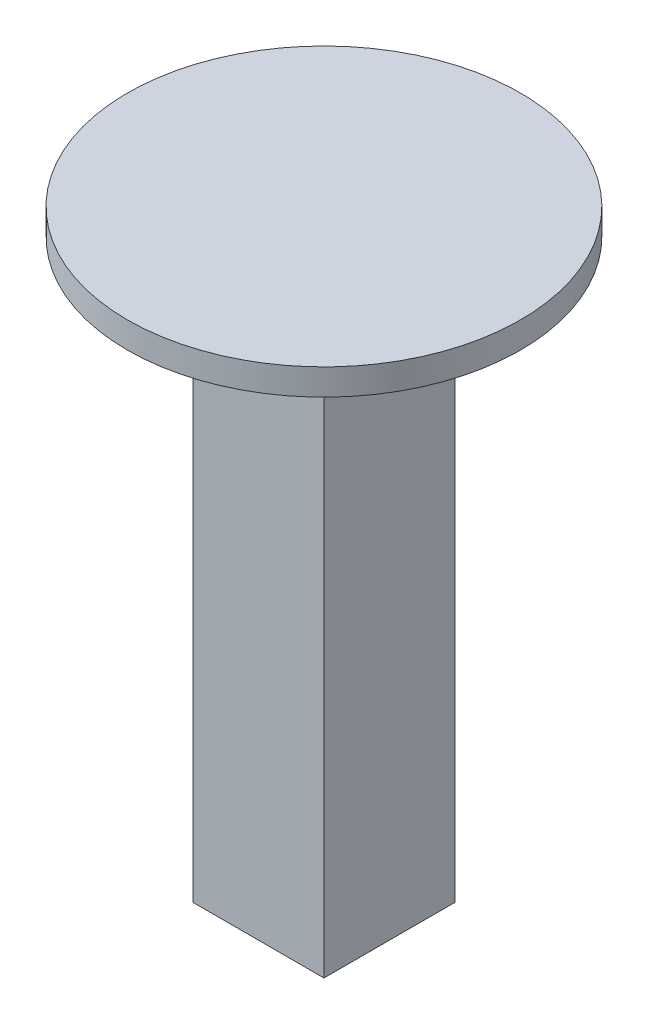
from build123d import *

# Parameters (mm, degrees)
SKETCH1_W           = 50
SKETCH1_H           = 50
BOSS_EXTRUDE1_DEPTH = 50
SKETCH4_W           = 50
SKETCH4_H           = 130
BOSS_EXTRUDE2_DEPTH = 5
SKETCH3_W           = 50
SKETCH3_H           = 130
BOSS_EXTRUDE3_DEPTH = 5
SKETCH2_W           = 50
SKETCH2_H           = 130
BOSS_EXTRUDE4_DEPTH = 5
SKETCH5_W           = 50
SKETCH5_H           = 130
BOSS_EXTRUDE5_DEPTH = 5
SKETCH6_W           = 50
SKETCH6_H           = 50
BOSS_EXTRUDE6_DEPTH = 50
SKETCH10_R          = 75
BOSS_EXTRUDE7_DEPTH = 10
SKETCH11_R          = 4
CUT_EXTRUDE1_DEPTH  = 22


with BuildPart() as part:
    # Sketch1 → Boss-Extrude1 (new body)
    with BuildSketch(Plane(origin=(0, 0, 0), x_dir=(1, 0, 0), z_dir=(0, 1, 0))):
        Rectangle(SKETCH1_W, SKETCH1_H)
    extrude(amount=BOSS_EXTRUDE1_DEPTH)

    # Sketch4 → Boss-Extrude2 (add)
    with BuildSketch(Plane(origin=(0, 0, -25), x_dir=(-1, 0, 0), z_dir=(0, 0, -1))):
        with Locations((0, 115)):
            Rectangle(SKETCH4_W, SKETCH4_H)
    extrude(amount=-BOSS_EXTRUDE2_DEPTH)

    # Sketch3 → Boss-Extrude3 (add)
    with BuildSketch(Plane(origin=(25, 0, 0), x_dir=(0, 0, -1), z_dir=(1, 0, 0))):
        with Locations((0, 115)):
            Rectangle(SKETCH3_W, SKETCH3_H)
    extrude(amount=-BOSS_EXTRUDE3_DEPTH)

    # Sketch2 → Boss-Extrude4 (add)
    with BuildSketch(Plane.XY.offset(25)):
        with Locations((0, 115)):
            Rectangle(SKETCH2_W, SKETCH2_H)
    extrude(amount=-BOSS_EXTRUDE4_DEPTH)

    # Sketch5 → Boss-Extrude5 (add)
    with BuildSketch(Plane.ZY.offset(25)):
        with Locations((0, 115)):
            Rectangle(SKETCH5_W, SKETCH5_H)
    extrude(amount=-BOSS_EXTRUDE5_DEPTH)

    # Sketch6 → Boss-Extrude6 (add)
    with BuildSketch(Plane(origin=(0, 180, 0), x_dir=(1, 0, 0), z_dir=(0, 1, 0))):
        Rectangle(SKETCH6_W, SKETCH6_H)
    extrude(amount=BOSS_EXTRUDE6_DEPTH)

    # Sketch10 → Boss-Extrude7 (add)
    with BuildSketch(Plane(origin=(0, 230, 0), x_dir=(1, 0, 0), z_dir=(0, 1, 0))):
        with Locations(Location((0, 0, 0), (0, 0, 270))):
            Circle(SKETCH10_R)
    extrude(amount=-BOSS_EXTRUDE7_DEPTH)

    # Sketch11 → Cut-Extrude1 (cut)
    with BuildSketch(Plane.XZ):
        with Locations(Location((0, 0, 0), (0, 0, 270))):
            Circle(SKETCH11_R)
    extrude(amount=-CUT_EXTRUDE1_DEPTH, mode=Mode.SUBTRACT)


solid = part.part
